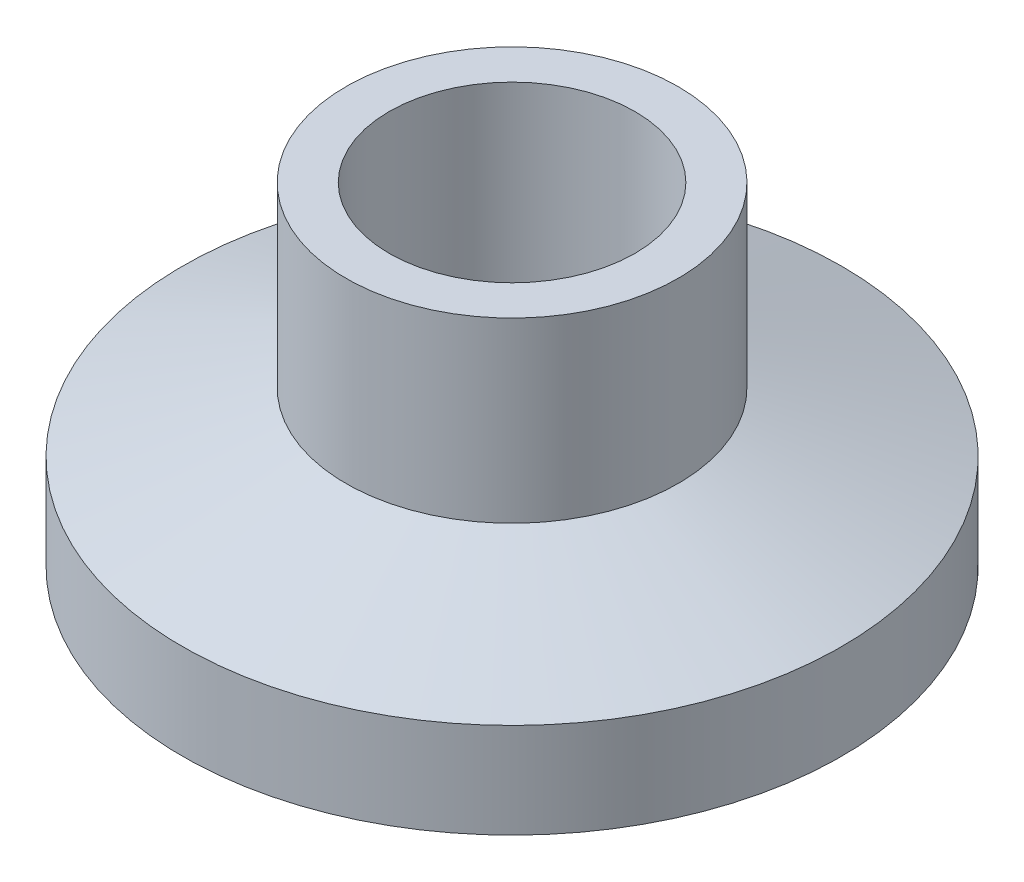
from build123d import *


with BuildPart() as part:
    # Sketch1 → Revolve1 (revolve)
    with BuildSketch(Plane.XY, mode=Mode.PRIVATE) as revolve1_sk:
        with BuildLine():
            Line((-4.699, 0.889), (-4.699, 12.7))
            Line((-4.699, 12.7), (-6.35, 12.7))
            Line((-6.35, 12.7), (-6.35, 5.906431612))
            Line((-6.35, 5.906431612), (-12.5984, 3.6322))
            Line((-12.5984, 3.6322), (-12.5984, 0))
            Line((-12.5984, 0), (-10.922, 0))
            Line((-10.922, 0), (-10.922, 1.3208))
            ThreePointArc((-10.922, 1.3208), (-10.433686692, 2.040621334), (-9.584339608, 1.852998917))
            Line((-9.584339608, 1.852998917), (-8.60238726, 0.889))
            Line((-8.60238726, 0.889), (-4.699, 0.889))
        make_face()
    revolve(revolve1_sk.sketch.rotate(Axis((0, 0, 0), (0, 1, 0)), 270), axis=Axis((0, 0, 0), (0, 1, 0)))


solid = part.part
